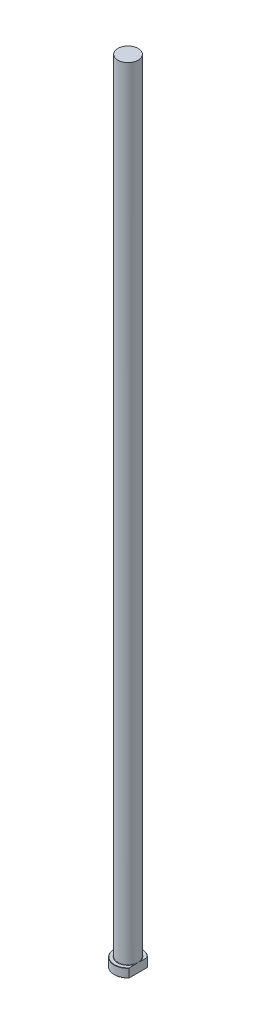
ISO-10303-21;
HEADER;
FILE_DESCRIPTION(('STEP AP214'),'2;1');
FILE_NAME('part.step','',(''),(''),'','','');
FILE_SCHEMA(('AUTOMOTIVE_DESIGN { 1 0 10303 214 1 1 1 1 }'));
ENDSEC;
DATA;
#1=APPLICATION_CONTEXT('core data for automotive mechanical design processes');
#2=APPLICATION_PROTOCOL_DEFINITION('international standard','automotive_design',2000,#1);
#3=PRODUCT_CONTEXT('',#1,'mechanical');
#4=PRODUCT('Part','Part','',(#3));
#5=PRODUCT_RELATED_PRODUCT_CATEGORY('part','',(#4));
#6=PRODUCT_DEFINITION_FORMATION('','',#4);
#7=PRODUCT_DEFINITION_CONTEXT('part definition',#1,'design');
#8=PRODUCT_DEFINITION('design','',#6,#7);
#9=PRODUCT_DEFINITION_SHAPE('','',#8);
#10=(LENGTH_UNIT() NAMED_UNIT(*) SI_UNIT(.MILLI.,.METRE.));
#11=(NAMED_UNIT(*) PLANE_ANGLE_UNIT() SI_UNIT($,.RADIAN.));
#12=(NAMED_UNIT(*) SI_UNIT($,.STERADIAN.) SOLID_ANGLE_UNIT());
#13=UNCERTAINTY_MEASURE_WITH_UNIT(LENGTH_MEASURE(1.E-05),#10,'distance_accuracy_value','');
#14=(GEOMETRIC_REPRESENTATION_CONTEXT(3) GLOBAL_UNCERTAINTY_ASSIGNED_CONTEXT((#13)) GLOBAL_UNIT_ASSIGNED_CONTEXT((#10,
#11,#12)) REPRESENTATION_CONTEXT('',''));
#15=CARTESIAN_POINT('',(0.,0.,0.));
#16=DIRECTION('',(0.,0.,1.));
#17=DIRECTION('',(1.,0.,0.));
#18=AXIS2_PLACEMENT_3D('',#15,#16,#17);
#19=CARTESIAN_POINT('',(0.,0.,0.));
#20=DIRECTION('',(0.,-1.,0.));
#21=DIRECTION('',(0.,0.,-1.));
#22=AXIS2_PLACEMENT_3D('',#19,#20,#21);
#23=PLANE('',#22);
#24=CARTESIAN_POINT('',(0.,0.,0.));
#25=DIRECTION('',(0.,-1.,0.));
#26=DIRECTION('',(0.,0.,-1.));
#27=AXIS2_PLACEMENT_3D('',#24,#25,#26);
#28=CIRCLE('',#27,10.8);
#29=CARTESIAN_POINT('',(8.09999999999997,0.,7.14352853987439));
#30=VERTEX_POINT('',#29);
#31=CARTESIAN_POINT('',(8.09999999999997,0.,-7.14352853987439));
#32=VERTEX_POINT('',#31);
#33=EDGE_CURVE('E98',#30,#32,#28,.T.);
#34=ORIENTED_EDGE('',*,*,#33,.T.);
#35=DIRECTION('',(0.,0.,1.));
#36=VECTOR('',#35,1.);
#37=CARTESIAN_POINT('',(8.09999999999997,0.,-7.44244583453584));
#38=LINE('',#37,#36);
#39=EDGE_CURVE('E83',#32,#30,#38,.T.);
#40=ORIENTED_EDGE('',*,*,#39,.T.);
#41=EDGE_LOOP('',(#34,#40));
#42=FACE_BOUND('',#41,.T.);
#43=ADVANCED_FACE('F32',(#42),#23,.T.);
#44=CARTESIAN_POINT('',(0.,259.958771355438,0.));
#45=DIRECTION('',(0.,1.,0.));
#46=DIRECTION('',(0.,0.,1.));
#47=AXIS2_PLACEMENT_3D('',#44,#45,#46);
#48=CYLINDRICAL_SURFACE('',#47,11.);
#49=CARTESIAN_POINT('',(0.,6.80000000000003,0.));
#50=DIRECTION('',(0.,1.,0.));
#51=DIRECTION('',(0.,0.,1.));
#52=AXIS2_PLACEMENT_3D('',#49,#50,#51);
#53=CIRCLE('',#52,11.);
#54=CARTESIAN_POINT('',(8.09999999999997,6.80000000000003,7.44244583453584));
#55=VERTEX_POINT('',#54);
#56=CARTESIAN_POINT('',(8.09999999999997,6.80000000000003,-7.44244583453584));
#57=VERTEX_POINT('',#56);
#58=EDGE_CURVE('E104',#55,#57,#53,.F.);
#59=ORIENTED_EDGE('',*,*,#58,.T.);
#60=DIRECTION('',(0.,-1.,0.));
#61=VECTOR('',#60,1.);
#62=CARTESIAN_POINT('',(8.09999999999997,630.,-7.44244583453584));
#63=LINE('',#62,#61);
#64=CARTESIAN_POINT('',(8.09999999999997,0.200000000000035,-7.44244583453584));
#65=VERTEX_POINT('',#64);
#66=EDGE_CURVE('E183',#57,#65,#63,.T.);
#67=ORIENTED_EDGE('',*,*,#66,.T.);
#68=CARTESIAN_POINT('',(0.,0.200000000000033,0.));
#69=DIRECTION('',(0.,-1.,0.));
#70=DIRECTION('',(0.,0.,-1.));
#71=AXIS2_PLACEMENT_3D('',#68,#69,#70);
#72=CIRCLE('',#71,11.);
#73=CARTESIAN_POINT('',(8.09999999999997,0.200000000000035,7.44244583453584));
#74=VERTEX_POINT('',#73);
#75=EDGE_CURVE('E100',#65,#74,#72,.F.);
#76=ORIENTED_EDGE('',*,*,#75,.T.);
#77=DIRECTION('',(0.,-1.,0.));
#78=VECTOR('',#77,1.);
#79=CARTESIAN_POINT('',(8.09999999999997,630.,7.44244583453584));
#80=LINE('',#79,#78);
#81=EDGE_CURVE('E93',#55,#74,#80,.T.);
#82=ORIENTED_EDGE('',*,*,#81,.F.);
#83=EDGE_LOOP('',(#59,#67,#76,#82));
#84=FACE_BOUND('',#83,.T.);
#85=ADVANCED_FACE('F158',(#84),#48,.T.);
#86=CARTESIAN_POINT('',(-11.,7.,0.));
#87=DIRECTION('',(0.,1.,0.));
#88=DIRECTION('',(0.,0.,1.));
#89=AXIS2_PLACEMENT_3D('',#86,#87,#88);
#90=PLANE('',#89);
#91=CARTESIAN_POINT('',(0.,7.,0.));
#92=DIRECTION('',(0.,1.,0.));
#93=DIRECTION('',(0.,0.,1.));
#94=AXIS2_PLACEMENT_3D('',#91,#92,#93);
#95=CIRCLE('',#94,10.8);
#96=CARTESIAN_POINT('',(8.09999999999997,7.,-7.14352853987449));
#97=VERTEX_POINT('',#96);
#98=CARTESIAN_POINT('',(8.09999999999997,7.,7.14352853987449));
#99=VERTEX_POINT('',#98);
#100=EDGE_CURVE('E178',#97,#99,#95,.T.);
#101=ORIENTED_EDGE('',*,*,#100,.T.);
#102=DIRECTION('',(0.,0.,-1.));
#103=VECTOR('',#102,1.);
#104=CARTESIAN_POINT('',(8.09999999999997,7.,0.));
#105=LINE('',#104,#103);
#106=CARTESIAN_POINT('',(8.09999999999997,6.99999999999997,2.22485954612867));
#107=VERTEX_POINT('',#106);
#108=EDGE_CURVE('E57',#99,#107,#105,.T.);
#109=ORIENTED_EDGE('',*,*,#108,.T.);
#110=CARTESIAN_POINT('',(0.,7.,0.));
#111=DIRECTION('',(0.,1.,0.));
#112=DIRECTION('',(0.,0.,1.));
#113=AXIS2_PLACEMENT_3D('',#110,#111,#112);
#114=CIRCLE('',#113,8.39999999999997);
#115=CARTESIAN_POINT('',(8.09999999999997,6.99999999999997,-2.22485954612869));
#116=VERTEX_POINT('',#115);
#117=EDGE_CURVE('E107',#107,#116,#114,.F.);
#118=ORIENTED_EDGE('',*,*,#117,.T.);
#119=EDGE_CURVE('E136',#116,#97,#105,.T.);
#120=ORIENTED_EDGE('',*,*,#119,.T.);
#121=EDGE_LOOP('',(#101,#109,#118,#120));
#122=FACE_BOUND('',#121,.T.);
#123=ADVANCED_FACE('F147',(#122),#90,.T.);
#124=CARTESIAN_POINT('',(0.,7.00000000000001,0.));
#125=DIRECTION('',(0.,-1.,0.));
#126=DIRECTION('',(0.,0.,-1.));
#127=AXIS2_PLACEMENT_3D('',#124,#125,#126);
#128=CONICAL_SURFACE('',#127,10.8,0.785398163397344);
#129=ORIENTED_EDGE('',*,*,#58,.F.);
#130=CARTESIAN_POINT('',(8.09999999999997,-0.46829354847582,16.3743869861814));
#131=CARTESIAN_POINT('',(8.09999999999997,-0.25436332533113,16.1357074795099));
#132=CARTESIAN_POINT('',(8.09999999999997,-0.0409370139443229,15.8965760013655));
#133=CARTESIAN_POINT('',(8.09999999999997,0.384762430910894,15.4172842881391));
#134=CARTESIAN_POINT('',(8.09999999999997,0.597035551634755,15.1771240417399));
#135=CARTESIAN_POINT('',(8.09999999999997,1.23203735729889,14.4547646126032));
#136=CARTESIAN_POINT('',(8.09999999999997,1.6528094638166,13.9708414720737));
#137=CARTESIAN_POINT('',(8.09999999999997,2.49198203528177,12.9919134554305));
#138=CARTESIAN_POINT('',(8.09999999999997,2.91030911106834,12.4968454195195));
#139=CARTESIAN_POINT('',(8.09999999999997,3.5306315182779,11.7483710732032));
#140=CARTESIAN_POINT('',(8.09999999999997,3.73619473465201,11.4979212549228));
#141=CARTESIAN_POINT('',(8.09999999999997,4.14450356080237,10.9947372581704));
#142=CARTESIAN_POINT('',(8.09999999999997,4.3472492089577,10.7420031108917));
#143=CARTESIAN_POINT('',(8.09999999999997,4.73433340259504,10.2529152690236));
#144=CARTESIAN_POINT('',(8.09999999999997,4.91891315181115,10.0167526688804));
#145=CARTESIAN_POINT('',(8.09999999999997,5.28467709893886,9.54181650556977));
#146=CARTESIAN_POINT('',(8.09999999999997,5.46586137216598,9.3030430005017));
#147=CARTESIAN_POINT('',(8.09999999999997,5.82427381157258,8.82234050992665));
#148=CARTESIAN_POINT('',(8.09999999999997,6.00149981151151,8.58040990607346));
#149=CARTESIAN_POINT('',(8.09999999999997,6.35105499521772,8.09303329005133));
#150=CARTESIAN_POINT('',(8.09999999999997,6.52338425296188,7.84758733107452));
#151=CARTESIAN_POINT('',(8.09999999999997,6.86170981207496,7.35313784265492));
#152=CARTESIAN_POINT('',(8.09999999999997,7.0277190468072,7.10414319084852));
#153=CARTESIAN_POINT('',(8.09999999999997,7.35243924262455,6.60139153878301));
#154=CARTESIAN_POINT('',(8.09999999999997,7.51114961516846,6.3476341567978));
#155=CARTESIAN_POINT('',(8.09999999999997,7.81934238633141,5.83485140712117));
#156=CARTESIAN_POINT('',(8.09999999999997,7.96883276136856,5.5758308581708));
#157=CARTESIAN_POINT('',(8.09999999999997,8.2564020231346,5.05156426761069));
#158=CARTESIAN_POINT('',(8.09999999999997,8.39448364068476,4.78631973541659));
#159=CARTESIAN_POINT('',(8.09999999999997,8.64733540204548,4.26720676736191));
#160=CARTESIAN_POINT('',(8.09999999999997,8.76305451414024,4.01380392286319));
#161=CARTESIAN_POINT('',(8.09999999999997,8.97906757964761,3.50043611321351));
#162=CARTESIAN_POINT('',(8.09999999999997,9.07936141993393,3.240471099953));
#163=CARTESIAN_POINT('',(8.09999999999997,9.26061269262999,2.71507213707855));
#164=CARTESIAN_POINT('',(8.09999999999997,9.3416527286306,2.44966705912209));
#165=CARTESIAN_POINT('',(8.09999999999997,9.48121180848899,1.91293243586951));
#166=CARTESIAN_POINT('',(8.09999999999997,9.53973286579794,1.64160342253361));
#167=CARTESIAN_POINT('',(8.09999999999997,9.63162156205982,1.0897723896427));
#168=CARTESIAN_POINT('',(8.09999999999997,9.66453368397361,0.809192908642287));
#169=CARTESIAN_POINT('',(8.09999999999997,9.70112845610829,0.246139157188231));
#170=CARTESIAN_POINT('',(8.09999999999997,9.70481576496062,-0.0363348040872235));
#171=CARTESIAN_POINT('',(8.09999999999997,9.68267265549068,-0.600479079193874));
#172=CARTESIAN_POINT('',(8.09999999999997,9.65680275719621,-0.882147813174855));
#173=CARTESIAN_POINT('',(8.09999999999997,9.57739238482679,-1.44154939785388));
#174=CARTESIAN_POINT('',(8.09999999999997,9.52384373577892,-1.71928106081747));
#175=CARTESIAN_POINT('',(8.09999999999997,9.37717365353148,-2.33286612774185));
#176=CARTESIAN_POINT('',(8.09999999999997,9.27774098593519,-2.66719445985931));
#177=CARTESIAN_POINT('',(8.09999999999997,9.04935963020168,-3.32555561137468));
#178=CARTESIAN_POINT('',(8.09999999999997,8.92039733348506,-3.64958360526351));
#179=CARTESIAN_POINT('',(8.09999999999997,8.70907658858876,-4.12987142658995));
#180=CARTESIAN_POINT('',(8.09999999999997,8.63516457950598,-4.28993932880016));
#181=CARTESIAN_POINT('',(8.09999999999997,8.4822322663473,-4.60762322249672));
#182=CARTESIAN_POINT('',(8.09999999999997,8.40321193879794,-4.76523920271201));
#183=CARTESIAN_POINT('',(8.09999999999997,8.24075032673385,-5.07810202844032));
#184=CARTESIAN_POINT('',(8.09999999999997,8.15731046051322,-5.23334961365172));
#185=CARTESIAN_POINT('',(8.09999999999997,7.98654878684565,-5.54168695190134));
#186=CARTESIAN_POINT('',(8.09999999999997,7.89922702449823,-5.69477672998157));
#187=CARTESIAN_POINT('',(8.09999999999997,7.66338960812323,-6.0977288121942));
#188=CARTESIAN_POINT('',(8.09999999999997,7.51195498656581,-6.34588392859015));
#189=CARTESIAN_POINT('',(8.09999999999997,7.20164049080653,-6.83751069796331));
#190=CARTESIAN_POINT('',(8.09999999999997,7.04275963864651,-7.0809817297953));
#191=CARTESIAN_POINT('',(8.09999999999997,6.71886431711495,-7.56397194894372));
#192=CARTESIAN_POINT('',(8.09999999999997,6.55384686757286,-7.80348913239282));
#193=CARTESIAN_POINT('',(8.09999999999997,6.21883875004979,-8.27899456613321));
#194=CARTESIAN_POINT('',(8.09999999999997,6.04884829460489,-8.51498296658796));
#195=CARTESIAN_POINT('',(8.09999999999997,5.70426867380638,-8.98455504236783));
#196=CARTESIAN_POINT('',(8.09999999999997,5.52966831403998,-9.2181304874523));
#197=CARTESIAN_POINT('',(8.09999999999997,5.17697958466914,-9.68263613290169));
#198=CARTESIAN_POINT('',(8.09999999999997,4.99889113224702,-9.91356627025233));
#199=CARTESIAN_POINT('',(8.09999999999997,4.46033384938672,-10.6027922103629));
#200=CARTESIAN_POINT('',(8.09999999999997,4.09547364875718,-11.0576577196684));
#201=CARTESIAN_POINT('',(8.09999999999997,3.38639212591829,-11.9247254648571));
#202=CARTESIAN_POINT('',(8.09999999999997,3.04281718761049,-12.3374594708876));
#203=CARTESIAN_POINT('',(8.09999999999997,2.35005516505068,-13.1582374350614));
#204=CARTESIAN_POINT('',(8.09999999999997,2.00086766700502,-13.5662810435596));
#205=CARTESIAN_POINT('',(8.09999999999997,1.3002776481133,-14.3760884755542));
#206=CARTESIAN_POINT('',(8.09999999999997,0.948901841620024,-14.7778754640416));
#207=CARTESIAN_POINT('',(8.09999999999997,0.242699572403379,-15.5783083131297));
#208=CARTESIAN_POINT('',(8.09999999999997,-0.112126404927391,-15.9769546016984));
#209=CARTESIAN_POINT('',(8.09999999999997,-0.46829354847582,-16.3743869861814));
#210=B_SPLINE_CURVE_WITH_KNOTS('',3,(#130,#131,#132,#133,#134,#135,#136,#137,#138,#139,#140,
#141,#142,#143,#144,#145,#146,#147,#148,#149,#150,#151,#152,#153,#154,#155,#156,#157,#158,#159,
#160,#161,#162,#163,#164,#165,#166,#167,#168,#169,#170,#171,#172,#173,#174,#175,#176,#177,#178,
#179,#180,#181,#182,#183,#184,#185,#186,#187,#188,#189,#190,#191,#192,#193,#194,#195,#196,#197,
#198,#199,#200,#201,#202,#203,#204,#205,#206,#207,#208,#209),.UNSPECIFIED.,.F.,.F.,(4,2,2,2,2,2,
2,2,2,2,2,2,2,2,2,2,2,2,2,2,2,2,2,2,2,2,2,2,2,2,2,2,2,2,2,2,2,2,2,4),(0.,0.961563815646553,
1.92313823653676,3.84691108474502,5.79124096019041,6.76324981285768,7.73524541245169,
8.63443178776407,9.53359819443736,10.4332451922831,11.3328785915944,12.2305594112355,
13.1283124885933,14.0252776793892,14.9220275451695,15.7573406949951,16.5926599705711,
17.4243280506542,18.255921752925,19.1019891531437,19.9479216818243,20.7949854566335,
21.6422995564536,22.686914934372,23.7320126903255,24.2608671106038,24.7897239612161,
25.3184121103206,25.8470941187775,26.7190513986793,27.5911235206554,28.4636248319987,
29.3360889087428,30.2109126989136,31.08575728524,32.8349455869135,34.4459592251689,
36.0570921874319,37.6583452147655,39.2593761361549),.UNSPECIFIED.);
#211=EDGE_CURVE('E135',#55,#99,#210,.T.);
#212=ORIENTED_EDGE('',*,*,#211,.T.);
#213=ORIENTED_EDGE('',*,*,#100,.F.);
#214=EDGE_CURVE('E127',#97,#57,#210,.T.);
#215=ORIENTED_EDGE('',*,*,#214,.T.);
#216=EDGE_LOOP('',(#129,#212,#213,#215));
#217=FACE_BOUND('',#216,.T.);
#218=ADVANCED_FACE('F143',(#217),#128,.T.);
#219=CARTESIAN_POINT('',(0.,0.200000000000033,0.));
#220=DIRECTION('',(0.,1.,0.));
#221=DIRECTION('',(0.,0.,1.));
#222=AXIS2_PLACEMENT_3D('',#219,#220,#221);
#223=CONICAL_SURFACE('',#222,11.,0.785398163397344);
#224=ORIENTED_EDGE('',*,*,#75,.F.);
#225=CARTESIAN_POINT('',(8.09999999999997,7.46829354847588,-16.3743869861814));
#226=CARTESIAN_POINT('',(8.09999999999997,7.25436332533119,-16.1357074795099));
#227=CARTESIAN_POINT('',(8.09999999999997,7.04093701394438,-15.8965760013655));
#228=CARTESIAN_POINT('',(8.09999999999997,6.61523756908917,-15.4172842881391));
#229=CARTESIAN_POINT('',(8.09999999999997,6.4029644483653,-15.1771240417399));
#230=CARTESIAN_POINT('',(8.09999999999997,5.76796264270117,-14.4547646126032));
#231=CARTESIAN_POINT('',(8.09999999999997,5.34719053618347,-13.9708414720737));
#232=CARTESIAN_POINT('',(8.09999999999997,4.5080179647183,-12.9919134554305));
#233=CARTESIAN_POINT('',(8.09999999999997,4.08969088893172,-12.4968454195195));
#234=CARTESIAN_POINT('',(8.09999999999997,3.46936848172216,-11.7483710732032));
#235=CARTESIAN_POINT('',(8.09999999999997,3.26380526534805,-11.4979212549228));
#236=CARTESIAN_POINT('',(8.09999999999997,2.85549643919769,-10.9947372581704));
#237=CARTESIAN_POINT('',(8.09999999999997,2.65275079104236,-10.7420031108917));
#238=CARTESIAN_POINT('',(8.09999999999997,2.26566659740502,-10.2529152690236));
#239=CARTESIAN_POINT('',(8.09999999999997,2.08108684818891,-10.0167526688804));
#240=CARTESIAN_POINT('',(8.09999999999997,1.7153229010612,-9.54181650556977));
#241=CARTESIAN_POINT('',(8.09999999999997,1.53413862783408,-9.30304300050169));
#242=CARTESIAN_POINT('',(8.09999999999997,1.17572618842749,-8.82234050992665));
#243=CARTESIAN_POINT('',(8.09999999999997,0.998500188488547,-8.58040990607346));
#244=CARTESIAN_POINT('',(8.09999999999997,0.648945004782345,-8.09303329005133));
#245=CARTESIAN_POINT('',(8.09999999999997,0.476615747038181,-7.84758733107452));
#246=CARTESIAN_POINT('',(8.09999999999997,0.1382901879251,-7.35313784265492));
#247=CARTESIAN_POINT('',(8.09999999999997,-0.0277190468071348,-7.10414319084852));
#248=CARTESIAN_POINT('',(8.09999999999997,-0.352439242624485,-6.60139153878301));
#249=CARTESIAN_POINT('',(8.09999999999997,-0.511149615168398,-6.3476341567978));
#250=CARTESIAN_POINT('',(8.09999999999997,-0.819342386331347,-5.83485140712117));
#251=CARTESIAN_POINT('',(8.09999999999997,-0.968832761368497,-5.5758308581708));
#252=CARTESIAN_POINT('',(8.09999999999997,-1.25640202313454,-5.05156426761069));
#253=CARTESIAN_POINT('',(8.09999999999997,-1.3944836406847,-4.78631973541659));
#254=CARTESIAN_POINT('',(8.09999999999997,-1.64733540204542,-4.2672067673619));
#255=CARTESIAN_POINT('',(8.09999999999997,-1.76305451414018,-4.01380392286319));
#256=CARTESIAN_POINT('',(8.09999999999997,-1.97906757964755,-3.50043611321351));
#257=CARTESIAN_POINT('',(8.09999999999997,-2.07936141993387,-3.24047109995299));
#258=CARTESIAN_POINT('',(8.09999999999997,-2.26061269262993,-2.71507213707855));
#259=CARTESIAN_POINT('',(8.09999999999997,-2.34165272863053,-2.44966705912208));
#260=CARTESIAN_POINT('',(8.09999999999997,-2.48121180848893,-1.9129324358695));
#261=CARTESIAN_POINT('',(8.09999999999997,-2.53973286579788,-1.6416034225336));
#262=CARTESIAN_POINT('',(8.09999999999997,-2.63162156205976,-1.08977238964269));
#263=CARTESIAN_POINT('',(8.09999999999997,-2.66453368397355,-0.80919290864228));
#264=CARTESIAN_POINT('',(8.09999999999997,-2.70112845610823,-0.246139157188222));
#265=CARTESIAN_POINT('',(8.09999999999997,-2.70481576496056,0.0363348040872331));
#266=CARTESIAN_POINT('',(8.09999999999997,-2.68267265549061,0.600479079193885));
#267=CARTESIAN_POINT('',(8.09999999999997,-2.65680275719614,0.882147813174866));
#268=CARTESIAN_POINT('',(8.09999999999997,-2.57739238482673,1.44154939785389));
#269=CARTESIAN_POINT('',(8.09999999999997,-2.52384373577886,1.71928106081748));
#270=CARTESIAN_POINT('',(8.09999999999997,-2.37717365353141,2.33286612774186));
#271=CARTESIAN_POINT('',(8.09999999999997,-2.27774098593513,2.66719445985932));
#272=CARTESIAN_POINT('',(8.09999999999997,-2.04935963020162,3.32555561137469));
#273=CARTESIAN_POINT('',(8.09999999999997,-1.92039733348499,3.64958360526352));
#274=CARTESIAN_POINT('',(8.09999999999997,-1.70907658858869,4.12987142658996));
#275=CARTESIAN_POINT('',(8.09999999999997,-1.63516457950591,4.28993932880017));
#276=CARTESIAN_POINT('',(8.09999999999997,-1.48223226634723,4.60762322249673));
#277=CARTESIAN_POINT('',(8.09999999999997,-1.40321193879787,4.76523920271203));
#278=CARTESIAN_POINT('',(8.09999999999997,-1.24075032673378,5.07810202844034));
#279=CARTESIAN_POINT('',(8.09999999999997,-1.15731046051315,5.23334961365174));
#280=CARTESIAN_POINT('',(8.09999999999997,-0.986548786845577,5.54168695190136));
#281=CARTESIAN_POINT('',(8.09999999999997,-0.899227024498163,5.69477672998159));
#282=CARTESIAN_POINT('',(8.09999999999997,-0.663389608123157,6.09772881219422));
#283=CARTESIAN_POINT('',(8.09999999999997,-0.511954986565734,6.34588392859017));
#284=CARTESIAN_POINT('',(8.09999999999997,-0.201640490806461,6.83751069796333));
#285=CARTESIAN_POINT('',(8.09999999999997,-0.0427596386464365,7.08098172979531));
#286=CARTESIAN_POINT('',(8.09999999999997,0.281135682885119,7.56397194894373));
#287=CARTESIAN_POINT('',(8.09999999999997,0.446153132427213,7.80348913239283));
#288=CARTESIAN_POINT('',(8.09999999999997,0.781161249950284,8.27899456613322));
#289=CARTESIAN_POINT('',(8.09999999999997,0.951151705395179,8.51498296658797));
#290=CARTESIAN_POINT('',(8.09999999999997,1.29573132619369,8.98455504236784));
#291=CARTESIAN_POINT('',(8.09999999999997,1.47033168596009,9.21813048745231));
#292=CARTESIAN_POINT('',(8.09999999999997,1.82302041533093,9.6826361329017));
#293=CARTESIAN_POINT('',(8.09999999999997,2.00110886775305,9.91356627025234));
#294=CARTESIAN_POINT('',(8.09999999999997,2.53966615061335,10.6027922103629));
#295=CARTESIAN_POINT('',(8.09999999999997,2.90452635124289,11.0576577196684));
#296=CARTESIAN_POINT('',(8.09999999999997,3.61360787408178,11.9247254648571));
#297=CARTESIAN_POINT('',(8.09999999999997,3.95718281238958,12.3374594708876));
#298=CARTESIAN_POINT('',(8.09999999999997,4.64994483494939,13.1582374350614));
#299=CARTESIAN_POINT('',(8.09999999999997,4.99913233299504,13.5662810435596));
#300=CARTESIAN_POINT('',(8.09999999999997,5.69972235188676,14.3760884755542));
#301=CARTESIAN_POINT('',(8.09999999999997,6.05109815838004,14.7778754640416));
#302=CARTESIAN_POINT('',(8.09999999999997,6.75730042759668,15.5783083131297));
#303=CARTESIAN_POINT('',(8.09999999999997,7.11212640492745,15.9769546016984));
#304=CARTESIAN_POINT('',(8.09999999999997,7.46829354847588,16.3743869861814));
#305=B_SPLINE_CURVE_WITH_KNOTS('',3,(#225,#226,#227,#228,#229,#230,#231,#232,#233,#234,#235,
#236,#237,#238,#239,#240,#241,#242,#243,#244,#245,#246,#247,#248,#249,#250,#251,#252,#253,#254,
#255,#256,#257,#258,#259,#260,#261,#262,#263,#264,#265,#266,#267,#268,#269,#270,#271,#272,#273,
#274,#275,#276,#277,#278,#279,#280,#281,#282,#283,#284,#285,#286,#287,#288,#289,#290,#291,#292,
#293,#294,#295,#296,#297,#298,#299,#300,#301,#302,#303,#304),.UNSPECIFIED.,.F.,.F.,(4,2,2,2,2,2,
2,2,2,2,2,2,2,2,2,2,2,2,2,2,2,2,2,2,2,2,2,2,2,2,2,2,2,2,2,2,2,2,2,4),(0.,0.961563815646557,
1.92313823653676,3.84691108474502,5.79124096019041,6.76324981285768,7.73524541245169,
8.63443178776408,9.53359819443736,10.4332451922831,11.3328785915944,12.2305594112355,
13.1283124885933,14.0252776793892,14.9220275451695,15.7573406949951,16.5926599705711,
17.4243280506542,18.255921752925,19.1019891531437,19.9479216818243,20.7949854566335,
21.6422995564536,22.686914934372,23.7320126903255,24.2608671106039,24.7897239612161,
25.3184121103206,25.8470941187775,26.7190513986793,27.5911235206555,28.4636248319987,
29.3360889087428,30.2109126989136,31.08575728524,32.8349455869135,34.4459592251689,
36.0570921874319,37.6583452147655,39.2593761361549),.UNSPECIFIED.);
#306=EDGE_CURVE('E86',#65,#32,#305,.T.);
#307=ORIENTED_EDGE('',*,*,#306,.T.);
#308=ORIENTED_EDGE('',*,*,#33,.F.);
#309=EDGE_CURVE('E89',#30,#74,#305,.T.);
#310=ORIENTED_EDGE('',*,*,#309,.T.);
#311=EDGE_LOOP('',(#224,#307,#308,#310));
#312=FACE_BOUND('',#311,.T.);
#313=ADVANCED_FACE('F97',(#312),#223,.T.);
#314=CARTESIAN_POINT('',(0.,7.29999999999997,0.));
#315=DIRECTION('',(0.,1.,0.));
#316=DIRECTION('',(0.,0.,1.));
#317=AXIS2_PLACEMENT_3D('',#314,#315,#316);
#318=TOROIDAL_SURFACE('',#317,8.39999999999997,0.3);
#319=CARTESIAN_POINT('',(8.09999999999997,7.29999999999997,0.));
#320=CARTESIAN_POINT('',(8.09999999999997,7.30000062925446,1.10217513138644E-10));
#321=CARTESIAN_POINT('',(8.09999999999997,7.30000125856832,-3.48372532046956E-07));
#322=CARTESIAN_POINT('',(8.09999999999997,7.30000242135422,-1.24325315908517E-06));
#323=CARTESIAN_POINT('',(8.09999999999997,7.30000291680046,-1.81407064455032E-06));
#324=CARTESIAN_POINT('',(8.09999999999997,7.30000399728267,-3.20556588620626E-06));
#325=CARTESIAN_POINT('',(8.09999999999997,7.30000456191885,-4.04857468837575E-06));
#326=CARTESIAN_POINT('',(8.09999999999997,7.30000552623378,-5.7486288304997E-06));
#327=CARTESIAN_POINT('',(8.09999999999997,7.30000593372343,-6.60186051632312E-06));
#328=CARTESIAN_POINT('',(8.09999999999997,7.30000755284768,-1.00751095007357E-05));
#329=CARTESIAN_POINT('',(8.09999999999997,7.30000870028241,-1.27308878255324E-05));
#330=CARTESIAN_POINT('',(8.09999999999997,7.30001048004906,-1.78566813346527E-05));
#331=CARTESIAN_POINT('',(8.09999999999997,7.30001115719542,-2.03116208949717E-05));
#332=CARTESIAN_POINT('',(8.09999999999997,7.30001416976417,-3.11399264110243E-05));
#333=CARTESIAN_POINT('',(8.09999999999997,7.30001656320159,-3.94979192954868E-05));
#334=CARTESIAN_POINT('',(8.09999999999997,7.30001991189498,-5.49761459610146E-05));
#335=CARTESIAN_POINT('',(8.09999999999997,7.30002104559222,-6.20568593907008E-05));
#336=CARTESIAN_POINT('',(8.09999999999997,7.30002955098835,-0.000115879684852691));
#337=CARTESIAN_POINT('',(8.09999999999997,7.30003630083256,-0.00016266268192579));
#338=CARTESIAN_POINT('',(8.09999999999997,7.30006581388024,-0.000349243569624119));
#339=CARTESIAN_POINT('',(8.09999999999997,7.30009364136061,-0.000488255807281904));
#340=CARTESIAN_POINT('',(8.09999999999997,7.30020321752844,-0.00104344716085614));
#341=CARTESIAN_POINT('',(8.09999999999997,7.30028192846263,-0.00145999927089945));
#342=CARTESIAN_POINT('',(8.09999999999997,7.30059961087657,-0.00313052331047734));
#343=CARTESIAN_POINT('',(8.09999999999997,7.30084255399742,-0.0043839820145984));
#344=CARTESIAN_POINT('',(8.09999999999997,7.30186079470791,-0.00964975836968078));
#345=CARTESIAN_POINT('',(8.09999999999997,7.30263102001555,-0.0136627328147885));
#346=CARTESIAN_POINT('',(8.09999999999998,7.30867561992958,-0.045139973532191));
#347=CARTESIAN_POINT('',(8.09999999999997,7.31396742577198,-0.0726020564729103));
#348=CARTESIAN_POINT('',(8.09999999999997,7.32431115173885,-0.126405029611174));
#349=CARTESIAN_POINT('',(8.09999999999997,7.32936401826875,-0.152745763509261));
#350=CARTESIAN_POINT('',(8.09999999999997,7.34587210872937,-0.238985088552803));
#351=CARTESIAN_POINT('',(8.09999999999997,7.35728443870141,-0.298892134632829));
#352=CARTESIAN_POINT('',(8.09999999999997,7.37648902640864,-0.400785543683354));
#353=CARTESIAN_POINT('',(8.09999999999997,7.38434094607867,-0.442760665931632));
#354=CARTESIAN_POINT('',(8.09999999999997,7.39967591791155,-0.525583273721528));
#355=CARTESIAN_POINT('',(8.09999999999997,7.40716317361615,-0.566429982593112));
#356=CARTESIAN_POINT('',(8.09999999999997,7.43255561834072,-0.706751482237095));
#357=CARTESIAN_POINT('',(8.09999999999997,7.45000488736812,-0.806310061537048));
#358=CARTESIAN_POINT('',(8.09999999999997,7.48336031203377,-1.00668681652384));
#359=CARTESIAN_POINT('',(8.09999999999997,7.49924974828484,-1.10750780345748));
#360=CARTESIAN_POINT('',(8.09999999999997,7.53002321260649,-1.31956600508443));
#361=CARTESIAN_POINT('',(8.09999999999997,7.5446499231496,-1.43084155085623));
#362=CARTESIAN_POINT('',(8.09999999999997,7.56967383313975,-1.65357260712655));
#363=CARTESIAN_POINT('',(8.09999999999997,7.58008243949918,-1.76502680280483));
#364=CARTESIAN_POINT('',(8.09999999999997,7.59481704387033,-1.98455781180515));
#365=CARTESIAN_POINT('',(8.09999999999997,7.59933894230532,-2.09261973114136));
#366=CARTESIAN_POINT('',(8.09999999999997,7.6002232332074,-2.25365680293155));
#367=CARTESIAN_POINT('',(8.09999999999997,7.59957115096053,-2.30661427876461));
#368=CARTESIAN_POINT('',(8.09999999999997,7.59593025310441,-2.41243717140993));
#369=CARTESIAN_POINT('',(8.09999999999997,7.59294242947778,-2.46530261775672));
#370=CARTESIAN_POINT('',(8.09999999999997,7.58438337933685,-2.56626617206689));
#371=CARTESIAN_POINT('',(8.09999999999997,7.57905558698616,-2.61438444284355));
#372=CARTESIAN_POINT('',(8.09999999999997,7.56511668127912,-2.71063967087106));
#373=CARTESIAN_POINT('',(8.09999999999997,7.55647540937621,-2.75877261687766));
#374=CARTESIAN_POINT('',(8.09999999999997,7.53997521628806,-2.83052401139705));
#375=CARTESIAN_POINT('',(8.09999999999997,7.5338289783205,-2.85453498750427));
#376=CARTESIAN_POINT('',(8.09999999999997,7.52005528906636,-2.90212319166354));
#377=CARTESIAN_POINT('',(8.09999999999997,7.51242879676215,-2.92570068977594));
#378=CARTESIAN_POINT('',(8.09999999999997,7.49534810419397,-2.97194486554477));
#379=CARTESIAN_POINT('',(8.09999999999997,7.48591141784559,-2.99461794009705));
#380=CARTESIAN_POINT('',(8.09999999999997,7.46452687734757,-3.0387244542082));
#381=CARTESIAN_POINT('',(8.09999999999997,7.4525885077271,-3.06016219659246));
#382=CARTESIAN_POINT('',(8.09999999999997,7.43211325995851,-3.09021268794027));
#383=CARTESIAN_POINT('',(8.09999999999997,7.42496972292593,-3.09976653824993));
#384=CARTESIAN_POINT('',(8.09999999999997,7.40960263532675,-3.11798598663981));
#385=CARTESIAN_POINT('',(8.09999999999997,7.40137953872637,-3.12665195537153));
#386=CARTESIAN_POINT('',(8.09999999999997,7.3859293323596,-3.14052845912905));
#387=CARTESIAN_POINT('',(8.09999999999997,7.37898924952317,-3.14605470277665));
#388=CARTESIAN_POINT('',(8.09999999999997,7.36434419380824,-3.15598943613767));
#389=CARTESIAN_POINT('',(8.09999999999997,7.35664068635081,-3.16040001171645));
#390=CARTESIAN_POINT('',(8.09999999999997,7.34254794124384,-3.16675602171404));
#391=CARTESIAN_POINT('',(8.09999999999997,7.33631410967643,-3.16904233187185));
#392=CARTESIAN_POINT('',(8.09999999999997,7.3235539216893,-3.17255113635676));
#393=CARTESIAN_POINT('',(8.09999999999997,7.31702793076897,-3.17377492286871));
#394=CARTESIAN_POINT('',(8.09999999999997,7.30382788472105,-3.17503459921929));
#395=CARTESIAN_POINT('',(8.09999999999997,7.29715327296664,-3.17506481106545));
#396=CARTESIAN_POINT('',(8.09999999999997,7.28390757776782,-3.1739190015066));
#397=CARTESIAN_POINT('',(8.09999999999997,7.27733655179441,-3.17274233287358));
#398=CARTESIAN_POINT('',(8.09999999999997,7.26486630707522,-3.16941116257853));
#399=CARTESIAN_POINT('',(8.09999999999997,7.25895027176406,-3.16731785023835));
#400=CARTESIAN_POINT('',(8.09999999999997,7.24746822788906,-3.16233639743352));
#401=CARTESIAN_POINT('',(8.09999999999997,7.24190232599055,-3.15944801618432));
#402=CARTESIAN_POINT('',(8.09999999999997,7.22717908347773,-3.15067054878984));
#403=CARTESIAN_POINT('',(8.09999999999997,7.21840505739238,-3.14414072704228));
#404=CARTESIAN_POINT('',(8.09999999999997,7.20193704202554,-3.129833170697));
#405=CARTESIAN_POINT('',(8.09999999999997,7.19424714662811,-3.12205093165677));
#406=CARTESIAN_POINT('',(8.09999999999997,7.17324842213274,-3.0982735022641));
#407=CARTESIAN_POINT('',(8.09999999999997,7.16115297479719,-3.08121965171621));
#408=CARTESIAN_POINT('',(8.09999999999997,7.13935274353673,-3.0457024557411));
#409=CARTESIAN_POINT('',(8.09999999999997,7.12965213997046,-3.02723671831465));
#410=CARTESIAN_POINT('',(8.09999999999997,7.10752548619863,-2.97992929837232));
#411=CARTESIAN_POINT('',(8.09999999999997,7.0962106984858,-2.95057306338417));
#412=CARTESIAN_POINT('',(8.09999999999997,7.07629636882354,-2.89093361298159));
#413=CARTESIAN_POINT('',(8.09999999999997,7.06770299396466,-2.86064846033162));
#414=CARTESIAN_POINT('',(8.09999999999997,7.05247262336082,-2.79917781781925));
#415=CARTESIAN_POINT('',(8.09999999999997,7.04586259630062,-2.76798573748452));
#416=CARTESIAN_POINT('',(8.09999999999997,7.03430884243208,-2.70534539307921));
#417=CARTESIAN_POINT('',(8.09999999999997,7.02936298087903,-2.67389751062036));
#418=CARTESIAN_POINT('',(8.09999999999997,7.01745043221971,-2.58601265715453));
#419=CARTESIAN_POINT('',(8.09999999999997,7.0119543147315,-2.52937710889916));
#420=CARTESIAN_POINT('',(8.09999999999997,7.00412918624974,-2.41587715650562));
#421=CARTESIAN_POINT('',(8.09999999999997,7.00180216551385,-2.35901263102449));
#422=CARTESIAN_POINT('',(8.09999999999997,6.99963684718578,-2.24502208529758));
#423=CARTESIAN_POINT('',(8.09999999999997,6.99980818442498,-2.18789590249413));
#424=CARTESIAN_POINT('',(8.09999999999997,7.00218365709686,-2.07368289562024));
#425=CARTESIAN_POINT('',(8.09999999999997,7.00438811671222,-2.01659607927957));
#426=CARTESIAN_POINT('',(8.09999999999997,7.01309255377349,-1.85323047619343));
#427=CARTESIAN_POINT('',(8.09999999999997,7.0216582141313,-1.74706244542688));
#428=CARTESIAN_POINT('',(8.09999999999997,7.04295526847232,-1.5351174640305));
#429=CARTESIAN_POINT('',(8.09999999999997,7.05568874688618,-1.42934073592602));
#430=CARTESIAN_POINT('',(8.09999999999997,7.08235098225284,-1.2318322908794));
#431=CARTESIAN_POINT('',(8.09999999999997,7.09591325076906,-1.14005018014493));
#432=CARTESIAN_POINT('',(8.09999999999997,7.12513315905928,-0.9542946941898));
#433=CARTESIAN_POINT('',(8.09999999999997,7.14083731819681,-0.860328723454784));
#434=CARTESIAN_POINT('',(8.09999999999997,7.16870636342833,-0.70016522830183));
#435=CARTESIAN_POINT('',(8.09999999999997,7.18055718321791,-0.633912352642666));
#436=CARTESIAN_POINT('',(8.09999999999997,7.20457571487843,-0.502251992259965));
#437=CARTESIAN_POINT('',(8.09999999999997,7.21673820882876,-0.436843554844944));
#438=CARTESIAN_POINT('',(8.09999999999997,7.2398995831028,-0.313742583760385));
#439=CARTESIAN_POINT('',(8.09999999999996,7.25086777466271,-0.256044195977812));
#440=CARTESIAN_POINT('',(8.09999999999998,7.27343224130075,-0.138123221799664));
#441=CARTESIAN_POINT('',(8.1,7.28503484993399,-0.0779017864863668));
#442=CARTESIAN_POINT('',(8.09999999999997,7.29737058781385,-0.0136537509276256));
#443=CARTESIAN_POINT('',(8.09999999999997,7.29814262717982,-0.00963182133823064));
#444=CARTESIAN_POINT('',(8.09999999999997,7.29916127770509,-0.00436406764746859));
#445=CARTESIAN_POINT('',(8.09999999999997,7.29940286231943,-0.00311759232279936));
#446=CARTESIAN_POINT('',(8.09999999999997,7.29971889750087,-0.00145572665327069));
#447=CARTESIAN_POINT('',(8.09999999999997,7.29979729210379,-0.00104084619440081));
#448=CARTESIAN_POINT('',(8.09999999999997,7.29990649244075,-0.000487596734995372));
#449=CARTESIAN_POINT('',(8.09999999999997,7.29993426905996,-0.000348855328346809));
#450=CARTESIAN_POINT('',(8.09999999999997,7.29996373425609,-0.000162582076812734));
#451=CARTESIAN_POINT('',(8.09999999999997,7.29997047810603,-0.000115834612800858));
#452=CARTESIAN_POINT('',(8.09999999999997,7.29997897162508,-6.20484364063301E-05));
#453=CARTESIAN_POINT('',(8.09999999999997,7.29998010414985,-5.49694536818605E-05));
#454=CARTESIAN_POINT('',(8.09999999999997,7.2999834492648,-3.94950080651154E-05));
#455=CARTESIAN_POINT('',(8.09999999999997,7.29998584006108,-3.11389816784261E-05));
#456=CARTESIAN_POINT('',(8.09999999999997,7.2999888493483,-2.03127732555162E-05));
#457=CARTESIAN_POINT('',(8.09999999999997,7.29998952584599,-1.78579621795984E-05));
#458=CARTESIAN_POINT('',(8.09999999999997,7.29999130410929,-1.27323428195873E-05));
#459=CARTESIAN_POINT('',(8.09999999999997,7.29999245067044,-1.00765914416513E-05));
#460=CARTESIAN_POINT('',(8.09999999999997,7.29999406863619,-6.60328060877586E-06));
#461=CARTESIAN_POINT('',(8.09999999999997,7.29999447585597,-5.74999364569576E-06));
#462=CARTESIAN_POINT('',(8.09999999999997,7.29999543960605,-4.04978039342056E-06));
#463=CARTESIAN_POINT('',(8.09999999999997,7.29999600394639,-3.2066645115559E-06));
#464=CARTESIAN_POINT('',(8.09999999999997,7.29999708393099,-1.81492874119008E-06));
#465=CARTESIAN_POINT('',(8.09999999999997,7.29999757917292,-1.24398865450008E-06));
#466=CARTESIAN_POINT('',(8.09999999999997,7.29999874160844,-3.48781227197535E-07));
#467=CARTESIAN_POINT('',(8.09999999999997,7.29999937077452,-1.10212428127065E-10));
#468=CARTESIAN_POINT('',(8.09999999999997,7.29999999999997,0.));
#469=B_SPLINE_CURVE_WITH_KNOTS('',3,(#319,#320,#321,#322,#323,#324,#325,#326,#327,#328,#329,
#330,#331,#332,#333,#334,#335,#336,#337,#338,#339,#340,#341,#342,#343,#344,#345,#346,#347,#348,
#349,#350,#351,#352,#353,#354,#355,#356,#357,#358,#359,#360,#361,#362,#363,#364,#365,#366,#367,
#368,#369,#370,#371,#372,#373,#374,#375,#376,#377,#378,#379,#380,#381,#382,#383,#384,#385,#386,
#387,#388,#389,#390,#391,#392,#393,#394,#395,#396,#397,#398,#399,#400,#401,#402,#403,#404,#405,
#406,#407,#408,#409,#410,#411,#412,#413,#414,#415,#416,#417,#418,#419,#420,#421,#422,#423,#424,
#425,#426,#427,#428,#429,#430,#431,#432,#433,#434,#435,#436,#437,#438,#439,#440,#441,#442,#443,
#444,#445,#446,#447,#448,#449,#450,#451,#452,#453,#454,#455,#456,#457,#458,#459,#460,#461,#462,
#463,#464,#465,#466,#467,#468),.UNSPECIFIED.,.T.,.F.,(4,2,2,2,2,2,2,2,2,2,2,2,2,2,2,2,2,2,2,2,2,
2,2,2,2,2,2,2,2,2,2,2,2,2,2,2,2,2,2,2,2,2,2,2,2,2,2,2,2,2,2,2,2,2,2,2,2,2,2,2,2,2,2,2,2,2,2,2,2,
2,2,2,2,2,4),(0.,1.94566340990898E-06,4.24386131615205E-06,7.26038347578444E-06,
1.00975804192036E-05,1.87517574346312E-05,2.63844155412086E-05,5.24378709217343E-05,
7.39294306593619E-05,0.000215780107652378,0.000640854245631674,0.00191288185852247,
0.00574292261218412,0.0180019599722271,0.101902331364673,0.182365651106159,0.365318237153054,
0.493427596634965,0.618009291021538,0.921227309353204,1.22740416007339,1.56404340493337,
1.89976611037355,2.22400400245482,2.38285103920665,2.54163065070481,2.68679810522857,
2.83331946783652,2.90764122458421,2.98191499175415,3.05550342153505,3.12881774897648,
3.16455086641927,3.2002690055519,3.22680903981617,3.25329908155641,3.27314054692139,
3.29295784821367,3.31286941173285,3.33279165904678,3.35154918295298,3.37031239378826,
3.40293243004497,3.43567252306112,3.49804358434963,3.5605227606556,3.65467478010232,
3.74903865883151,3.84463288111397,3.94010400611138,4.11067190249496,4.28134686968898,
4.45268021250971,4.6240408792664,4.94344863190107,5.26301637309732,5.54133137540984,
5.8271264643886,6.02903811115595,6.22862558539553,6.4048211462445,6.58880446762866,
6.60109089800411,6.6048995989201,6.60616652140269,6.60659076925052,6.6067325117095,
6.60675399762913,6.60678004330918,6.60678767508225,6.60679632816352,6.60679916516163,
6.60680218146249,6.60680447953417,6.60680642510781),.UNSPECIFIED.);
#470=CARTESIAN_POINT('',(8.09999999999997,7.29999999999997,0.));
#471=VERTEX_POINT('',#470);
#472=EDGE_CURVE('E11',#116,#471,#469,.T.);
#473=ORIENTED_EDGE('',*,*,#472,.F.);
#474=ORIENTED_EDGE('',*,*,#117,.F.);
#475=CARTESIAN_POINT('',(8.09999999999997,7.29999999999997,0.));
#476=CARTESIAN_POINT('',(8.09999999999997,7.29999937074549,-1.10217625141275E-10));
#477=CARTESIAN_POINT('',(8.09999999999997,7.29999874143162,3.48372532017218E-07));
#478=CARTESIAN_POINT('',(8.09999999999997,7.29999757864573,1.24325315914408E-06));
#479=CARTESIAN_POINT('',(8.09999999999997,7.29999708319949,1.81407064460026E-06));
#480=CARTESIAN_POINT('',(8.09999999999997,7.29999600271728,3.20556588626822E-06));
#481=CARTESIAN_POINT('',(8.09999999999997,7.29999543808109,4.04857468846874E-06));
#482=CARTESIAN_POINT('',(8.09999999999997,7.29999447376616,5.74862883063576E-06));
#483=CARTESIAN_POINT('',(8.09999999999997,7.29999406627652,6.60186051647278E-06));
#484=CARTESIAN_POINT('',(8.09999999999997,7.29999244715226,1.00751095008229E-05));
#485=CARTESIAN_POINT('',(8.09999999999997,7.29999129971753,1.27308878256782E-05));
#486=CARTESIAN_POINT('',(8.09999999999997,7.29998951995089,1.78566813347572E-05));
#487=CARTESIAN_POINT('',(8.09999999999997,7.29998884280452,2.03116208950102E-05));
#488=CARTESIAN_POINT('',(8.09999999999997,7.29998583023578,3.11399264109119E-05));
#489=CARTESIAN_POINT('',(8.09999999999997,7.29998343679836,3.94979192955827E-05));
#490=CARTESIAN_POINT('',(8.09999999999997,7.29998008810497,5.49761459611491E-05));
#491=CARTESIAN_POINT('',(8.09999999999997,7.29997895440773,6.20568593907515E-05));
#492=CARTESIAN_POINT('',(8.09999999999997,7.29997044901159,0.000115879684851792));
#493=CARTESIAN_POINT('',(8.09999999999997,7.29996369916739,0.000162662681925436));
#494=CARTESIAN_POINT('',(8.09999999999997,7.29993418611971,0.000349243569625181));
#495=CARTESIAN_POINT('',(8.09999999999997,7.29990635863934,0.000488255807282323));
#496=CARTESIAN_POINT('',(8.09999999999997,7.2997967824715,0.00104344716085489));
#497=CARTESIAN_POINT('',(8.09999999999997,7.29971807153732,0.00145999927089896));
#498=CARTESIAN_POINT('',(8.09999999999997,7.29940038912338,0.00313052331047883));
#499=CARTESIAN_POINT('',(8.09999999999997,7.29915744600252,0.004383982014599));
#500=CARTESIAN_POINT('',(8.09999999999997,7.29813920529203,0.00964975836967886));
#501=CARTESIAN_POINT('',(8.09999999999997,7.29736897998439,0.0136627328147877));
#502=CARTESIAN_POINT('',(8.09999999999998,7.2913243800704,0.0451399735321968));
#503=CARTESIAN_POINT('',(8.09999999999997,7.28603257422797,0.0726020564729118));
#504=CARTESIAN_POINT('',(8.09999999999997,7.27568884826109,0.126405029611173));
#505=CARTESIAN_POINT('',(8.09999999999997,7.27063598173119,0.15274576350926));
#506=CARTESIAN_POINT('',(8.09999999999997,7.25412789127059,0.238985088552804));
#507=CARTESIAN_POINT('',(8.09999999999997,7.24271556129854,0.29889213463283));
#508=CARTESIAN_POINT('',(8.09999999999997,7.22351097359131,0.400785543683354));
#509=CARTESIAN_POINT('',(8.09999999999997,7.21565905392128,0.442760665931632));
#510=CARTESIAN_POINT('',(8.09999999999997,7.20032408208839,0.525583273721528));
#511=CARTESIAN_POINT('',(8.09999999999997,7.19283682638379,0.566429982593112));
#512=CARTESIAN_POINT('',(8.09999999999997,7.16744438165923,0.706751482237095));
#513=CARTESIAN_POINT('',(8.09999999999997,7.14999511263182,0.806310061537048));
#514=CARTESIAN_POINT('',(8.09999999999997,7.11663968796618,1.00668681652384));
#515=CARTESIAN_POINT('',(8.09999999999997,7.1007502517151,1.10750780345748));
#516=CARTESIAN_POINT('',(8.09999999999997,7.06997678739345,1.31956600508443));
#517=CARTESIAN_POINT('',(8.09999999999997,7.05535007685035,1.43084155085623));
#518=CARTESIAN_POINT('',(8.09999999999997,7.0303261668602,1.65357260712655));
#519=CARTESIAN_POINT('',(8.09999999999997,7.01991756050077,1.76502680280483));
#520=CARTESIAN_POINT('',(8.09999999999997,7.00518295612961,1.98455781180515));
#521=CARTESIAN_POINT('',(8.09999999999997,7.00066105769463,2.09261973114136));
#522=CARTESIAN_POINT('',(8.09999999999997,6.99977676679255,2.25365680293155));
#523=CARTESIAN_POINT('',(8.09999999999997,7.00042884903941,2.30661427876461));
#524=CARTESIAN_POINT('',(8.09999999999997,7.00406974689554,2.41243717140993));
#525=CARTESIAN_POINT('',(8.09999999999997,7.00705757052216,2.46530261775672));
#526=CARTESIAN_POINT('',(8.09999999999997,7.0156166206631,2.56626617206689));
#527=CARTESIAN_POINT('',(8.09999999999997,7.02094441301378,2.61438444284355));
#528=CARTESIAN_POINT('',(8.09999999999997,7.03488331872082,2.71063967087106));
#529=CARTESIAN_POINT('',(8.09999999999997,7.04352459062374,2.75877261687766));
#530=CARTESIAN_POINT('',(8.09999999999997,7.06002478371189,2.83052401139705));
#531=CARTESIAN_POINT('',(8.09999999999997,7.06617102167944,2.85453498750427));
#532=CARTESIAN_POINT('',(8.09999999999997,7.07994471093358,2.90212319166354));
#533=CARTESIAN_POINT('',(8.09999999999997,7.0875712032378,2.92570068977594));
#534=CARTESIAN_POINT('',(8.09999999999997,7.10465189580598,2.97194486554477));
#535=CARTESIAN_POINT('',(8.09999999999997,7.11408858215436,2.99461794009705));
#536=CARTESIAN_POINT('',(8.09999999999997,7.13547312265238,3.0387244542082));
#537=CARTESIAN_POINT('',(8.09999999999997,7.14741149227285,3.06016219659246));
#538=CARTESIAN_POINT('',(8.09999999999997,7.16788674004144,3.09021268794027));
#539=CARTESIAN_POINT('',(8.09999999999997,7.17503027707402,3.09976653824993));
#540=CARTESIAN_POINT('',(8.09999999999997,7.1903973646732,3.11798598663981));
#541=CARTESIAN_POINT('',(8.09999999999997,7.19862046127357,3.12665195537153));
#542=CARTESIAN_POINT('',(8.09999999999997,7.21407066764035,3.14052845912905));
#543=CARTESIAN_POINT('',(8.09999999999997,7.22101075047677,3.14605470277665));
#544=CARTESIAN_POINT('',(8.09999999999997,7.2356558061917,3.15598943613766));
#545=CARTESIAN_POINT('',(8.09999999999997,7.24335931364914,3.16040001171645));
#546=CARTESIAN_POINT('',(8.09999999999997,7.2574520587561,3.16675602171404));
#547=CARTESIAN_POINT('',(8.09999999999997,7.26368589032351,3.16904233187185));
#548=CARTESIAN_POINT('',(8.09999999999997,7.27644607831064,3.17255113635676));
#549=CARTESIAN_POINT('',(8.09999999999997,7.28297206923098,3.17377492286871));
#550=CARTESIAN_POINT('',(8.09999999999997,7.2961721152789,3.17503459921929));
#551=CARTESIAN_POINT('',(8.09999999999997,7.3028467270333,3.17506481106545));
#552=CARTESIAN_POINT('',(8.09999999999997,7.31609242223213,3.1739190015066));
#553=CARTESIAN_POINT('',(8.09999999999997,7.32266344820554,3.17274233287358));
#554=CARTESIAN_POINT('',(8.09999999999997,7.33513369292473,3.16941116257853));
#555=CARTESIAN_POINT('',(8.09999999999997,7.34104972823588,3.16731785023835));
#556=CARTESIAN_POINT('',(8.09999999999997,7.35253177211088,3.16233639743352));
#557=CARTESIAN_POINT('',(8.09999999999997,7.3580976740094,3.15944801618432));
#558=CARTESIAN_POINT('',(8.09999999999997,7.37282091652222,3.15067054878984));
#559=CARTESIAN_POINT('',(8.09999999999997,7.38159494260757,3.14414072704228));
#560=CARTESIAN_POINT('',(8.09999999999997,7.39806295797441,3.129833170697));
#561=CARTESIAN_POINT('',(8.09999999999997,7.40575285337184,3.12205093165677));
#562=CARTESIAN_POINT('',(8.09999999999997,7.42675157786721,3.0982735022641));
#563=CARTESIAN_POINT('',(8.09999999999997,7.43884702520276,3.08121965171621));
#564=CARTESIAN_POINT('',(8.09999999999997,7.46064725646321,3.0457024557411));
#565=CARTESIAN_POINT('',(8.09999999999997,7.47034786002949,3.02723671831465));
#566=CARTESIAN_POINT('',(8.09999999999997,7.49247451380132,2.97992929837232));
#567=CARTESIAN_POINT('',(8.09999999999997,7.50378930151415,2.95057306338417));
#568=CARTESIAN_POINT('',(8.09999999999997,7.52370363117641,2.89093361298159));
#569=CARTESIAN_POINT('',(8.09999999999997,7.53229700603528,2.86064846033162));
#570=CARTESIAN_POINT('',(8.09999999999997,7.54752737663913,2.79917781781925));
#571=CARTESIAN_POINT('',(8.09999999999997,7.55413740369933,2.76798573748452));
#572=CARTESIAN_POINT('',(8.09999999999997,7.56569115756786,2.70534539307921));
#573=CARTESIAN_POINT('',(8.09999999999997,7.57063701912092,2.67389751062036));
#574=CARTESIAN_POINT('',(8.09999999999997,7.58254956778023,2.58601265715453));
#575=CARTESIAN_POINT('',(8.09999999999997,7.58804568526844,2.52937710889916));
#576=CARTESIAN_POINT('',(8.09999999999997,7.59587081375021,2.41587715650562));
#577=CARTESIAN_POINT('',(8.09999999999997,7.5981978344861,2.35901263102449));
#578=CARTESIAN_POINT('',(8.09999999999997,7.60036315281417,2.24502208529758));
#579=CARTESIAN_POINT('',(8.09999999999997,7.60019181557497,2.18789590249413));
#580=CARTESIAN_POINT('',(8.09999999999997,7.59781634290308,2.07368289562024));
#581=CARTESIAN_POINT('',(8.09999999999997,7.59561188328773,2.01659607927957));
#582=CARTESIAN_POINT('',(8.09999999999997,7.58690744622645,1.85323047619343));
#583=CARTESIAN_POINT('',(8.09999999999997,7.57834178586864,1.74706244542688));
#584=CARTESIAN_POINT('',(8.09999999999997,7.55704473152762,1.5351174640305));
#585=CARTESIAN_POINT('',(8.09999999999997,7.54431125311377,1.42934073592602));
#586=CARTESIAN_POINT('',(8.09999999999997,7.51764901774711,1.2318322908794));
#587=CARTESIAN_POINT('',(8.09999999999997,7.50408674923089,1.14005018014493));
#588=CARTESIAN_POINT('',(8.09999999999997,7.47486684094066,0.9542946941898));
#589=CARTESIAN_POINT('',(8.09999999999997,7.45916268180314,0.860328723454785));
#590=CARTESIAN_POINT('',(8.09999999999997,7.43129363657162,0.70016522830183));
#591=CARTESIAN_POINT('',(8.09999999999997,7.41944281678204,0.633912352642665));
#592=CARTESIAN_POINT('',(8.09999999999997,7.39542428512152,0.502251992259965));
#593=CARTESIAN_POINT('',(8.09999999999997,7.38326179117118,0.436843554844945));
#594=CARTESIAN_POINT('',(8.09999999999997,7.36010041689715,0.313742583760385));
#595=CARTESIAN_POINT('',(8.09999999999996,7.34913222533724,0.256044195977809));
#596=CARTESIAN_POINT('',(8.09999999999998,7.32656775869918,0.138123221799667));
#597=CARTESIAN_POINT('',(8.1,7.31496515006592,0.0779017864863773));
#598=CARTESIAN_POINT('',(8.09999999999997,7.3026294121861,0.0136537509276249));
#599=CARTESIAN_POINT('',(8.09999999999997,7.30185737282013,0.00963182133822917));
#600=CARTESIAN_POINT('',(8.09999999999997,7.30083872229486,0.00436406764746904));
#601=CARTESIAN_POINT('',(8.09999999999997,7.30059713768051,0.00311759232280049));
#602=CARTESIAN_POINT('',(8.09999999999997,7.30028110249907,0.00145572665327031));
#603=CARTESIAN_POINT('',(8.09999999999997,7.30020270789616,0.00104084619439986));
#604=CARTESIAN_POINT('',(8.09999999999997,7.30009350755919,0.000487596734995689));
#605=CARTESIAN_POINT('',(8.09999999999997,7.30006573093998,0.000348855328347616));
#606=CARTESIAN_POINT('',(8.09999999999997,7.30003626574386,0.000162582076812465));
#607=CARTESIAN_POINT('',(8.09999999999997,7.30002952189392,0.000115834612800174));
#608=CARTESIAN_POINT('',(8.09999999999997,7.30002102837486,6.20484364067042E-05));
#609=CARTESIAN_POINT('',(8.09999999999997,7.30001989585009,5.49694536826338E-05));
#610=CARTESIAN_POINT('',(8.09999999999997,7.30001655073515,3.9495008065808E-05));
#611=CARTESIAN_POINT('',(8.09999999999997,7.30001415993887,3.11389816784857E-05));
#612=CARTESIAN_POINT('',(8.09999999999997,7.30001115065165,2.03127732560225E-05));
#613=CARTESIAN_POINT('',(8.09999999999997,7.30001047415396,1.78579621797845E-05));
#614=CARTESIAN_POINT('',(8.09999999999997,7.30000869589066,1.27323428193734E-05));
#615=CARTESIAN_POINT('',(8.09999999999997,7.3000075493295,1.00765914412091E-05));
#616=CARTESIAN_POINT('',(8.09999999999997,7.30000593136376,6.60328060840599E-06));
#617=CARTESIAN_POINT('',(8.09999999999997,7.30000552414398,5.74999364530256E-06));
#618=CARTESIAN_POINT('',(8.09999999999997,7.3000045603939,4.04978039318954E-06));
#619=CARTESIAN_POINT('',(8.09999999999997,7.30000399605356,3.20666451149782E-06));
#620=CARTESIAN_POINT('',(8.09999999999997,7.30000291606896,1.81492874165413E-06));
#621=CARTESIAN_POINT('',(8.09999999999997,7.30000242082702,1.24398865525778E-06));
#622=CARTESIAN_POINT('',(8.09999999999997,7.3000012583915,3.48781227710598E-07));
#623=CARTESIAN_POINT('',(8.09999999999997,7.30000062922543,1.10212540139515E-10));
#624=CARTESIAN_POINT('',(8.09999999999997,7.29999999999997,0.));
#625=B_SPLINE_CURVE_WITH_KNOTS('',3,(#475,#476,#477,#478,#479,#480,#481,#482,#483,#484,#485,
#486,#487,#488,#489,#490,#491,#492,#493,#494,#495,#496,#497,#498,#499,#500,#501,#502,#503,#504,
#505,#506,#507,#508,#509,#510,#511,#512,#513,#514,#515,#516,#517,#518,#519,#520,#521,#522,#523,
#524,#525,#526,#527,#528,#529,#530,#531,#532,#533,#534,#535,#536,#537,#538,#539,#540,#541,#542,
#543,#544,#545,#546,#547,#548,#549,#550,#551,#552,#553,#554,#555,#556,#557,#558,#559,#560,#561,
#562,#563,#564,#565,#566,#567,#568,#569,#570,#571,#572,#573,#574,#575,#576,#577,#578,#579,#580,
#581,#582,#583,#584,#585,#586,#587,#588,#589,#590,#591,#592,#593,#594,#595,#596,#597,#598,#599,
#600,#601,#602,#603,#604,#605,#606,#607,#608,#609,#610,#611,#612,#613,#614,#615,#616,#617,#618,
#619,#620,#621,#622,#623,#624),.UNSPECIFIED.,.T.,.F.,(4,2,2,2,2,2,2,2,2,2,2,2,2,2,2,2,2,2,2,2,2,
2,2,2,2,2,2,2,2,2,2,2,2,2,2,2,2,2,2,2,2,2,2,2,2,2,2,2,2,2,2,2,2,2,2,2,2,2,2,2,2,2,2,2,2,2,2,2,2,
2,2,2,2,2,4),(0.,1.94566340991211E-06,4.24386131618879E-06,7.26038347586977E-06,
1.00975804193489E-05,1.87517574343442E-05,2.6384415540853E-05,5.24378709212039E-05,
7.39294306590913E-05,0.000215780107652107,0.000640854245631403,0.0019128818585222,
0.00574292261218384,0.0180019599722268,0.101902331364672,0.182365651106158,0.365318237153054,
0.493427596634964,0.618009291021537,0.921227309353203,1.22740416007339,1.56404340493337,
1.89976611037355,2.22400400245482,2.38285103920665,2.54163065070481,2.68679810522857,
2.83331946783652,2.90764122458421,2.98191499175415,3.05550342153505,3.12881774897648,
3.16455086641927,3.2002690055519,3.22680903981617,3.25329908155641,3.27314054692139,
3.29295784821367,3.31286941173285,3.33279165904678,3.35154918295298,3.37031239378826,
3.40293243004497,3.43567252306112,3.49804358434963,3.5605227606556,3.65467478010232,
3.74903865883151,3.84463288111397,3.94010400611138,4.11067190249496,4.28134686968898,
4.45268021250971,4.6240408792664,4.94344863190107,5.26301637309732,5.54133137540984,
5.8271264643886,6.02903811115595,6.22862558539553,6.4048211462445,6.58880446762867,
6.60109089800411,6.6048995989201,6.60616652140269,6.60659076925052,6.6067325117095,
6.60675399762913,6.60678004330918,6.60678767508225,6.60679632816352,6.60679916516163,
6.60680218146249,6.60680447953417,6.60680642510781),.UNSPECIFIED.);
#626=EDGE_CURVE('E46',#471,#107,#625,.T.);
#627=ORIENTED_EDGE('',*,*,#626,.F.);
#628=CARTESIAN_POINT('',(0.,7.29999999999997,0.));
#629=DIRECTION('',(0.,1.,0.));
#630=DIRECTION('',(0.,0.,1.));
#631=AXIS2_PLACEMENT_3D('',#628,#629,#630);
#632=CIRCLE('',#631,8.09999999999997);
#633=EDGE_CURVE('E103',#471,#471,#632,.T.);
#634=ORIENTED_EDGE('',*,*,#633,.F.);
#635=EDGE_LOOP('',(#473,#474,#627,#634));
#636=FACE_BOUND('',#635,.T.);
#637=ADVANCED_FACE('F34',(#636),#318,.F.);
#638=CARTESIAN_POINT('',(0.,259.958771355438,0.));
#639=DIRECTION('',(0.,1.,0.));
#640=DIRECTION('',(0.,0.,1.));
#641=AXIS2_PLACEMENT_3D('',#638,#639,#640);
#642=CYLINDRICAL_SURFACE('',#641,8.09999999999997);
#643=ORIENTED_EDGE('',*,*,#633,.T.);
#644=EDGE_LOOP('',(#643));
#645=FACE_BOUND('',#644,.T.);
#646=CARTESIAN_POINT('',(0.,630.,0.));
#647=DIRECTION('',(0.,1.,0.));
#648=DIRECTION('',(0.,0.,1.));
#649=AXIS2_PLACEMENT_3D('',#646,#647,#648);
#650=CIRCLE('',#649,8.09999999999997);
#651=CARTESIAN_POINT('',(0.,630.,8.09999999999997));
#652=VERTEX_POINT('',#651);
#653=EDGE_CURVE('E101',#652,#652,#650,.T.);
#654=ORIENTED_EDGE('',*,*,#653,.F.);
#655=EDGE_LOOP('',(#654));
#656=FACE_BOUND('',#655,.T.);
#657=ADVANCED_FACE('F155',(#645,#656),#642,.T.);
#658=CARTESIAN_POINT('',(-8.09999999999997,630.,0.));
#659=DIRECTION('',(0.,1.,0.));
#660=DIRECTION('',(0.,0.,1.));
#661=AXIS2_PLACEMENT_3D('',#658,#659,#660);
#662=PLANE('',#661);
#663=ORIENTED_EDGE('',*,*,#653,.T.);
#664=EDGE_LOOP('',(#663));
#665=FACE_BOUND('',#664,.T.);
#666=ADVANCED_FACE('F121',(#665),#662,.T.);
#667=CARTESIAN_POINT('',(8.09999999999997,630.,-7.44244583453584));
#668=DIRECTION('',(1.,0.,0.));
#669=DIRECTION('',(0.,0.,-1.));
#670=AXIS2_PLACEMENT_3D('',#667,#668,#669);
#671=PLANE('',#670);
#672=ORIENTED_EDGE('',*,*,#66,.F.);
#673=ORIENTED_EDGE('',*,*,#214,.F.);
#674=ORIENTED_EDGE('',*,*,#119,.F.);
#675=ORIENTED_EDGE('',*,*,#472,.T.);
#676=ORIENTED_EDGE('',*,*,#626,.T.);
#677=ORIENTED_EDGE('',*,*,#108,.F.);
#678=ORIENTED_EDGE('',*,*,#211,.F.);
#679=ORIENTED_EDGE('',*,*,#81,.T.);
#680=ORIENTED_EDGE('',*,*,#309,.F.);
#681=ORIENTED_EDGE('',*,*,#39,.F.);
#682=ORIENTED_EDGE('',*,*,#306,.F.);
#683=EDGE_LOOP('',(#672,#673,#674,#675,#676,#677,#678,#679,#680,#681,#682));
#684=FACE_BOUND('',#683,.T.);
#685=ADVANCED_FACE('F85',(#684),#671,.T.);
#686=CLOSED_SHELL('',(#43,#85,#123,#218,#313,#637,#657,#666,#685));
#687=MANIFOLD_SOLID_BREP('B2',#686);
#688=ADVANCED_BREP_SHAPE_REPRESENTATION('',(#18,#687),#14);
#689=SHAPE_DEFINITION_REPRESENTATION(#9,#688);
ENDSEC;
END-ISO-10303-21;
